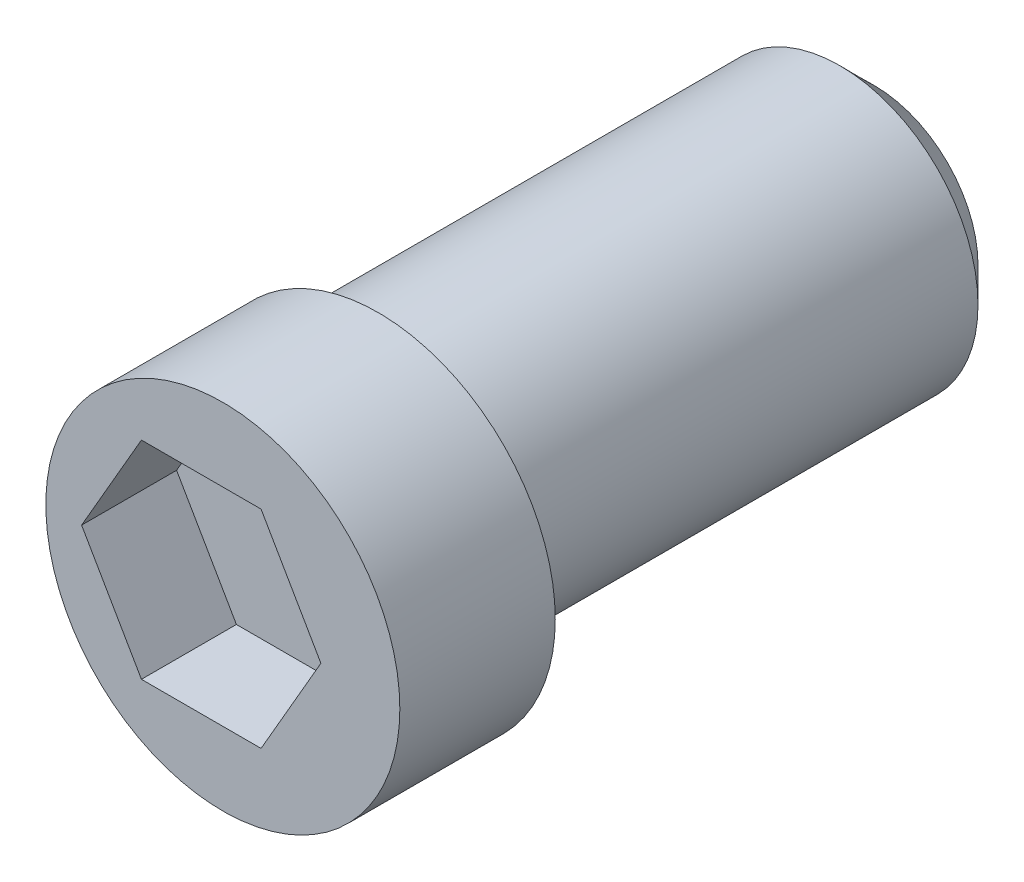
ISO-10303-21;
HEADER;
FILE_DESCRIPTION(('STEP AP214'),'2;1');
FILE_NAME('part.step','',(''),(''),'','','');
FILE_SCHEMA(('AUTOMOTIVE_DESIGN { 1 0 10303 214 1 1 1 1 }'));
ENDSEC;
DATA;
#1=APPLICATION_CONTEXT('core data for automotive mechanical design processes');
#2=APPLICATION_PROTOCOL_DEFINITION('international standard','automotive_design',2000,#1);
#3=PRODUCT_CONTEXT('',#1,'mechanical');
#4=PRODUCT('Part','Part','',(#3));
#5=PRODUCT_RELATED_PRODUCT_CATEGORY('part','',(#4));
#6=PRODUCT_DEFINITION_FORMATION('','',#4);
#7=PRODUCT_DEFINITION_CONTEXT('part definition',#1,'design');
#8=PRODUCT_DEFINITION('design','',#6,#7);
#9=PRODUCT_DEFINITION_SHAPE('','',#8);
#10=(LENGTH_UNIT() NAMED_UNIT(*) SI_UNIT(.MILLI.,.METRE.));
#11=(NAMED_UNIT(*) PLANE_ANGLE_UNIT() SI_UNIT($,.RADIAN.));
#12=(NAMED_UNIT(*) SI_UNIT($,.STERADIAN.) SOLID_ANGLE_UNIT());
#13=UNCERTAINTY_MEASURE_WITH_UNIT(LENGTH_MEASURE(1.E-05),#10,'distance_accuracy_value','');
#14=(GEOMETRIC_REPRESENTATION_CONTEXT(3) GLOBAL_UNCERTAINTY_ASSIGNED_CONTEXT((#13)) GLOBAL_UNIT_ASSIGNED_CONTEXT((#10,
#11,#12)) REPRESENTATION_CONTEXT('',''));
#15=CARTESIAN_POINT('',(0.,0.,0.));
#16=DIRECTION('',(0.,0.,1.));
#17=DIRECTION('',(1.,0.,0.));
#18=AXIS2_PLACEMENT_3D('',#15,#16,#17);
#19=CARTESIAN_POINT('',(0.,-7.9375,0.));
#20=DIRECTION('',(0.,0.,1.));
#21=DIRECTION('',(-1.,0.,0.));
#22=AXIS2_PLACEMENT_3D('',#19,#20,#21);
#23=PLANE('',#22);
#24=CARTESIAN_POINT('',(0.,0.,0.));
#25=DIRECTION('',(0.,0.,1.));
#26=DIRECTION('',(1.,0.,0.));
#27=AXIS2_PLACEMENT_3D('',#24,#25,#26);
#28=CIRCLE('',#27,8.);
#29=CARTESIAN_POINT('',(8.,0.,0.));
#30=VERTEX_POINT('',#29);
#31=EDGE_CURVE('E117',#30,#30,#28,.F.);
#32=ORIENTED_EDGE('',*,*,#31,.F.);
#33=EDGE_LOOP('',(#32));
#34=FACE_BOUND('',#33,.T.);
#35=CARTESIAN_POINT('',(1.27,0.,0.));
#36=DIRECTION('',(0.,0.,1.));
#37=DIRECTION('',(1.,0.,0.));
#38=AXIS2_PLACEMENT_3D('',#35,#36,#37);
#39=CIRCLE('',#38,10.25);
#40=CARTESIAN_POINT('',(11.52,0.,0.));
#41=VERTEX_POINT('',#40);
#42=EDGE_CURVE('E104',#41,#41,#39,.T.);
#43=ORIENTED_EDGE('',*,*,#42,.F.);
#44=EDGE_LOOP('',(#43));
#45=FACE_BOUND('',#44,.T.);
#46=ADVANCED_FACE('F14',(#34,#45),#23,.F.);
#47=CARTESIAN_POINT('',(0.,0.,-30.));
#48=DIRECTION('',(0.,0.,1.));
#49=DIRECTION('',(1.,0.,0.));
#50=AXIS2_PLACEMENT_3D('',#47,#48,#49);
#51=CYLINDRICAL_SURFACE('',#50,8.);
#52=CARTESIAN_POINT('',(0.,0.,-28.));
#53=DIRECTION('',(0.,0.,-1.));
#54=DIRECTION('',(-1.,0.,0.));
#55=AXIS2_PLACEMENT_3D('',#52,#53,#54);
#56=CIRCLE('',#55,8.);
#57=CARTESIAN_POINT('',(-8.,0.,-28.));
#58=VERTEX_POINT('',#57);
#59=EDGE_CURVE('E9',#58,#58,#56,.F.);
#60=ORIENTED_EDGE('',*,*,#59,.T.);
#61=EDGE_LOOP('',(#60));
#62=FACE_BOUND('',#61,.T.);
#63=ORIENTED_EDGE('',*,*,#31,.T.);
#64=EDGE_LOOP('',(#63));
#65=FACE_BOUND('',#64,.T.);
#66=ADVANCED_FACE('F140',(#62,#65),#51,.T.);
#67=CARTESIAN_POINT('',(0.,0.,-30.));
#68=DIRECTION('',(0.,0.,-1.));
#69=DIRECTION('',(-1.,0.,0.));
#70=AXIS2_PLACEMENT_3D('',#67,#68,#69);
#71=PLANE('',#70);
#72=CARTESIAN_POINT('',(0.,0.,-30.));
#73=DIRECTION('',(0.,0.,-1.));
#74=DIRECTION('',(-1.,0.,0.));
#75=AXIS2_PLACEMENT_3D('',#72,#73,#74);
#76=CIRCLE('',#75,6.);
#77=CARTESIAN_POINT('',(-6.,0.,-30.));
#78=VERTEX_POINT('',#77);
#79=EDGE_CURVE('E22',#78,#78,#76,.T.);
#80=ORIENTED_EDGE('',*,*,#79,.T.);
#81=EDGE_LOOP('',(#80));
#82=FACE_BOUND('',#81,.T.);
#83=ADVANCED_FACE('F127',(#82),#71,.T.);
#84=CARTESIAN_POINT('',(0.,0.,-30.));
#85=DIRECTION('',(0.,0.,1.));
#86=DIRECTION('',(1.,0.,0.));
#87=AXIS2_PLACEMENT_3D('',#84,#85,#86);
#88=CONICAL_SURFACE('',#87,6.,0.785398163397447);
#89=ORIENTED_EDGE('',*,*,#59,.F.);
#90=EDGE_LOOP('',(#89));
#91=FACE_BOUND('',#90,.T.);
#92=ORIENTED_EDGE('',*,*,#79,.F.);
#93=EDGE_LOOP('',(#92));
#94=FACE_BOUND('',#93,.T.);
#95=ADVANCED_FACE('F16',(#91,#94),#88,.T.);
#96=CARTESIAN_POINT('',(1.27,0.,-1.));
#97=DIRECTION('',(0.,0.,1.));
#98=DIRECTION('',(1.,0.,0.));
#99=AXIS2_PLACEMENT_3D('',#96,#97,#98);
#100=CYLINDRICAL_SURFACE('',#99,10.25);
#101=CARTESIAN_POINT('',(1.27,0.,9.));
#102=DIRECTION('',(0.,0.,1.));
#103=DIRECTION('',(1.,0.,0.));
#104=AXIS2_PLACEMENT_3D('',#101,#102,#103);
#105=CIRCLE('',#104,10.25);
#106=CARTESIAN_POINT('',(11.52,0.,9.));
#107=VERTEX_POINT('',#106);
#108=EDGE_CURVE('E264',#107,#107,#105,.T.);
#109=ORIENTED_EDGE('',*,*,#108,.F.);
#110=EDGE_LOOP('',(#109));
#111=FACE_BOUND('',#110,.T.);
#112=ORIENTED_EDGE('',*,*,#42,.T.);
#113=EDGE_LOOP('',(#112));
#114=FACE_BOUND('',#113,.T.);
#115=ADVANCED_FACE('F130',(#111,#114),#100,.T.);
#116=CARTESIAN_POINT('',(0.02,0.,3.5));
#117=DIRECTION('',(0.,0.,1.));
#118=DIRECTION('',(1.,0.,0.));
#119=AXIS2_PLACEMENT_3D('',#116,#117,#118);
#120=PLANE('',#119);
#121=DIRECTION('',(-0.5,-0.866025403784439,0.));
#122=VECTOR('',#121,1.);
#123=CARTESIAN_POINT('',(-3.44410161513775,6.,3.5));
#124=LINE('',#123,#122);
#125=CARTESIAN_POINT('',(-3.44410161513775,6.,3.5));
#126=VERTEX_POINT('',#125);
#127=CARTESIAN_POINT('',(-6.90820323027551,0.,3.5));
#128=VERTEX_POINT('',#127);
#129=EDGE_CURVE('E115',#126,#128,#124,.T.);
#130=ORIENTED_EDGE('',*,*,#129,.T.);
#131=DIRECTION('',(0.5,-0.866025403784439,0.));
#132=VECTOR('',#131,1.);
#133=CARTESIAN_POINT('',(-6.90820323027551,0.,3.5));
#134=LINE('',#133,#132);
#135=CARTESIAN_POINT('',(-3.44410161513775,-6.,3.5));
#136=VERTEX_POINT('',#135);
#137=EDGE_CURVE('E97',#128,#136,#134,.T.);
#138=ORIENTED_EDGE('',*,*,#137,.T.);
#139=DIRECTION('',(1.,0.,0.));
#140=VECTOR('',#139,1.);
#141=CARTESIAN_POINT('',(-3.44410161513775,-6.,3.5));
#142=LINE('',#141,#140);
#143=CARTESIAN_POINT('',(3.48410161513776,-6.,3.5));
#144=VERTEX_POINT('',#143);
#145=EDGE_CURVE('E95',#136,#144,#142,.T.);
#146=ORIENTED_EDGE('',*,*,#145,.T.);
#147=DIRECTION('',(0.5,0.866025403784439,0.));
#148=VECTOR('',#147,1.);
#149=CARTESIAN_POINT('',(3.48410161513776,-6.,3.5));
#150=LINE('',#149,#148);
#151=CARTESIAN_POINT('',(6.94820323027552,0.,3.5));
#152=VERTEX_POINT('',#151);
#153=EDGE_CURVE('E74',#144,#152,#150,.T.);
#154=ORIENTED_EDGE('',*,*,#153,.T.);
#155=DIRECTION('',(-0.5,0.866025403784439,0.));
#156=VECTOR('',#155,1.);
#157=CARTESIAN_POINT('',(6.94820323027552,0.,3.5));
#158=LINE('',#157,#156);
#159=CARTESIAN_POINT('',(3.48410161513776,6.,3.5));
#160=VERTEX_POINT('',#159);
#161=EDGE_CURVE('E85',#152,#160,#158,.T.);
#162=ORIENTED_EDGE('',*,*,#161,.T.);
#163=DIRECTION('',(-1.,0.,0.));
#164=VECTOR('',#163,1.);
#165=CARTESIAN_POINT('',(3.48410161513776,6.,3.5));
#166=LINE('',#165,#164);
#167=EDGE_CURVE('E89',#160,#126,#166,.T.);
#168=ORIENTED_EDGE('',*,*,#167,.T.);
#169=EDGE_LOOP('',(#130,#138,#146,#154,#162,#168));
#170=FACE_BOUND('',#169,.T.);
#171=ADVANCED_FACE('F92',(#170),#120,.T.);
#172=CARTESIAN_POINT('',(-3.44410161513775,-6.,3.5));
#173=DIRECTION('',(0.,-1.,0.));
#174=DIRECTION('',(0.,0.,-1.));
#175=AXIS2_PLACEMENT_3D('',#172,#173,#174);
#176=PLANE('',#175);
#177=DIRECTION('',(1.,0.,0.));
#178=VECTOR('',#177,1.);
#179=CARTESIAN_POINT('',(-3.44410161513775,-6.,9.));
#180=LINE('',#179,#178);
#181=CARTESIAN_POINT('',(-3.44410161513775,-6.,9.));
#182=VERTEX_POINT('',#181);
#183=CARTESIAN_POINT('',(3.48410161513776,-6.,9.));
#184=VERTEX_POINT('',#183);
#185=EDGE_CURVE('E107',#182,#184,#180,.T.);
#186=ORIENTED_EDGE('',*,*,#185,.T.);
#187=DIRECTION('',(0.,0.,1.));
#188=VECTOR('',#187,1.);
#189=CARTESIAN_POINT('',(3.48410161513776,-6.,3.5));
#190=LINE('',#189,#188);
#191=EDGE_CURVE('E82',#144,#184,#190,.T.);
#192=ORIENTED_EDGE('',*,*,#191,.F.);
#193=ORIENTED_EDGE('',*,*,#145,.F.);
#194=DIRECTION('',(0.,0.,1.));
#195=VECTOR('',#194,1.);
#196=CARTESIAN_POINT('',(-3.44410161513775,-6.,3.5));
#197=LINE('',#196,#195);
#198=EDGE_CURVE('E120',#136,#182,#197,.T.);
#199=ORIENTED_EDGE('',*,*,#198,.T.);
#200=EDGE_LOOP('',(#186,#192,#193,#199));
#201=FACE_BOUND('',#200,.T.);
#202=ADVANCED_FACE('F166',(#201),#176,.F.);
#203=CARTESIAN_POINT('',(3.48410161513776,-6.,3.5));
#204=DIRECTION('',(0.866025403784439,-0.5,0.));
#205=DIRECTION('',(0.5,0.866025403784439,0.));
#206=AXIS2_PLACEMENT_3D('',#203,#204,#205);
#207=PLANE('',#206);
#208=DIRECTION('',(0.5,0.866025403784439,0.));
#209=VECTOR('',#208,1.);
#210=CARTESIAN_POINT('',(3.48410161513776,-6.,9.));
#211=LINE('',#210,#209);
#212=CARTESIAN_POINT('',(6.94820323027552,0.,9.));
#213=VERTEX_POINT('',#212);
#214=EDGE_CURVE('E77',#184,#213,#211,.T.);
#215=ORIENTED_EDGE('',*,*,#214,.T.);
#216=DIRECTION('',(0.,0.,1.));
#217=VECTOR('',#216,1.);
#218=CARTESIAN_POINT('',(6.94820323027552,0.,3.5));
#219=LINE('',#218,#217);
#220=EDGE_CURVE('E70',#152,#213,#219,.T.);
#221=ORIENTED_EDGE('',*,*,#220,.F.);
#222=ORIENTED_EDGE('',*,*,#153,.F.);
#223=ORIENTED_EDGE('',*,*,#191,.T.);
#224=EDGE_LOOP('',(#215,#221,#222,#223));
#225=FACE_BOUND('',#224,.T.);
#226=ADVANCED_FACE('F72',(#225),#207,.F.);
#227=CARTESIAN_POINT('',(6.94820323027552,0.,3.5));
#228=DIRECTION('',(0.866025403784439,0.5,0.));
#229=DIRECTION('',(-0.5,0.866025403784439,0.));
#230=AXIS2_PLACEMENT_3D('',#227,#228,#229);
#231=PLANE('',#230);
#232=DIRECTION('',(-0.5,0.866025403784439,0.));
#233=VECTOR('',#232,1.);
#234=CARTESIAN_POINT('',(6.94820323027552,0.,9.));
#235=LINE('',#234,#233);
#236=CARTESIAN_POINT('',(3.48410161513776,6.,9.));
#237=VERTEX_POINT('',#236);
#238=EDGE_CURVE('E111',#213,#237,#235,.T.);
#239=ORIENTED_EDGE('',*,*,#238,.T.);
#240=DIRECTION('',(0.,0.,1.));
#241=VECTOR('',#240,1.);
#242=CARTESIAN_POINT('',(3.48410161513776,6.,3.5));
#243=LINE('',#242,#241);
#244=EDGE_CURVE('E81',#160,#237,#243,.T.);
#245=ORIENTED_EDGE('',*,*,#244,.F.);
#246=ORIENTED_EDGE('',*,*,#161,.F.);
#247=ORIENTED_EDGE('',*,*,#220,.T.);
#248=EDGE_LOOP('',(#239,#245,#246,#247));
#249=FACE_BOUND('',#248,.T.);
#250=ADVANCED_FACE('F86',(#249),#231,.F.);
#251=CARTESIAN_POINT('',(3.48410161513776,6.,3.5));
#252=DIRECTION('',(0.,1.,0.));
#253=DIRECTION('',(0.,0.,1.));
#254=AXIS2_PLACEMENT_3D('',#251,#252,#253);
#255=PLANE('',#254);
#256=DIRECTION('',(-1.,0.,0.));
#257=VECTOR('',#256,1.);
#258=CARTESIAN_POINT('',(3.48410161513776,6.,9.));
#259=LINE('',#258,#257);
#260=CARTESIAN_POINT('',(-3.44410161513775,6.,9.));
#261=VERTEX_POINT('',#260);
#262=EDGE_CURVE('E113',#237,#261,#259,.T.);
#263=ORIENTED_EDGE('',*,*,#262,.T.);
#264=DIRECTION('',(0.,0.,1.));
#265=VECTOR('',#264,1.);
#266=CARTESIAN_POINT('',(-3.44410161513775,6.,3.5));
#267=LINE('',#266,#265);
#268=EDGE_CURVE('E37',#126,#261,#267,.T.);
#269=ORIENTED_EDGE('',*,*,#268,.F.);
#270=ORIENTED_EDGE('',*,*,#167,.F.);
#271=ORIENTED_EDGE('',*,*,#244,.T.);
#272=EDGE_LOOP('',(#263,#269,#270,#271));
#273=FACE_BOUND('',#272,.T.);
#274=ADVANCED_FACE('F162',(#273),#255,.F.);
#275=CARTESIAN_POINT('',(-3.44410161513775,6.,3.5));
#276=DIRECTION('',(-0.866025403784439,0.5,0.));
#277=DIRECTION('',(-0.5,-0.866025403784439,0.));
#278=AXIS2_PLACEMENT_3D('',#275,#276,#277);
#279=PLANE('',#278);
#280=DIRECTION('',(-0.5,-0.866025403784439,0.));
#281=VECTOR('',#280,1.);
#282=CARTESIAN_POINT('',(-3.44410161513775,6.,9.));
#283=LINE('',#282,#281);
#284=CARTESIAN_POINT('',(-6.90820323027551,0.,9.));
#285=VERTEX_POINT('',#284);
#286=EDGE_CURVE('E29',#261,#285,#283,.T.);
#287=ORIENTED_EDGE('',*,*,#286,.T.);
#288=DIRECTION('',(0.,0.,1.));
#289=VECTOR('',#288,1.);
#290=CARTESIAN_POINT('',(-6.90820323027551,0.,3.5));
#291=LINE('',#290,#289);
#292=EDGE_CURVE('E59',#128,#285,#291,.T.);
#293=ORIENTED_EDGE('',*,*,#292,.F.);
#294=ORIENTED_EDGE('',*,*,#129,.F.);
#295=ORIENTED_EDGE('',*,*,#268,.T.);
#296=EDGE_LOOP('',(#287,#293,#294,#295));
#297=FACE_BOUND('',#296,.T.);
#298=ADVANCED_FACE('F159',(#297),#279,.F.);
#299=CARTESIAN_POINT('',(-6.90820323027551,0.,3.5));
#300=DIRECTION('',(-0.866025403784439,-0.5,0.));
#301=DIRECTION('',(0.5,-0.866025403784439,0.));
#302=AXIS2_PLACEMENT_3D('',#299,#300,#301);
#303=PLANE('',#302);
#304=DIRECTION('',(0.5,-0.866025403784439,0.));
#305=VECTOR('',#304,1.);
#306=CARTESIAN_POINT('',(-6.90820323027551,0.,9.));
#307=LINE('',#306,#305);
#308=EDGE_CURVE('E103',#285,#182,#307,.T.);
#309=ORIENTED_EDGE('',*,*,#308,.T.);
#310=ORIENTED_EDGE('',*,*,#198,.F.);
#311=ORIENTED_EDGE('',*,*,#137,.F.);
#312=ORIENTED_EDGE('',*,*,#292,.T.);
#313=EDGE_LOOP('',(#309,#310,#311,#312));
#314=FACE_BOUND('',#313,.T.);
#315=ADVANCED_FACE('F157',(#314),#303,.F.);
#316=CARTESIAN_POINT('',(1.27,0.,9.));
#317=DIRECTION('',(0.,0.,-1.));
#318=DIRECTION('',(1.,0.,0.));
#319=AXIS2_PLACEMENT_3D('',#316,#317,#318);
#320=PLANE('',#319);
#321=ORIENTED_EDGE('',*,*,#308,.F.);
#322=ORIENTED_EDGE('',*,*,#286,.F.);
#323=ORIENTED_EDGE('',*,*,#262,.F.);
#324=ORIENTED_EDGE('',*,*,#238,.F.);
#325=ORIENTED_EDGE('',*,*,#214,.F.);
#326=ORIENTED_EDGE('',*,*,#185,.F.);
#327=EDGE_LOOP('',(#321,#322,#323,#324,#325,#326));
#328=FACE_BOUND('',#327,.T.);
#329=ORIENTED_EDGE('',*,*,#108,.T.);
#330=EDGE_LOOP('',(#329));
#331=FACE_BOUND('',#330,.T.);
#332=ADVANCED_FACE('F154',(#328,#331),#320,.F.);
#333=CLOSED_SHELL('',(#46,#66,#83,#95,#115,#171,#202,#226,#250,#274,#298,#315,#332));
#334=MANIFOLD_SOLID_BREP('B1',#333);
#335=ADVANCED_BREP_SHAPE_REPRESENTATION('',(#18,#334),#14);
#336=SHAPE_DEFINITION_REPRESENTATION(#9,#335);
ENDSEC;
END-ISO-10303-21;
